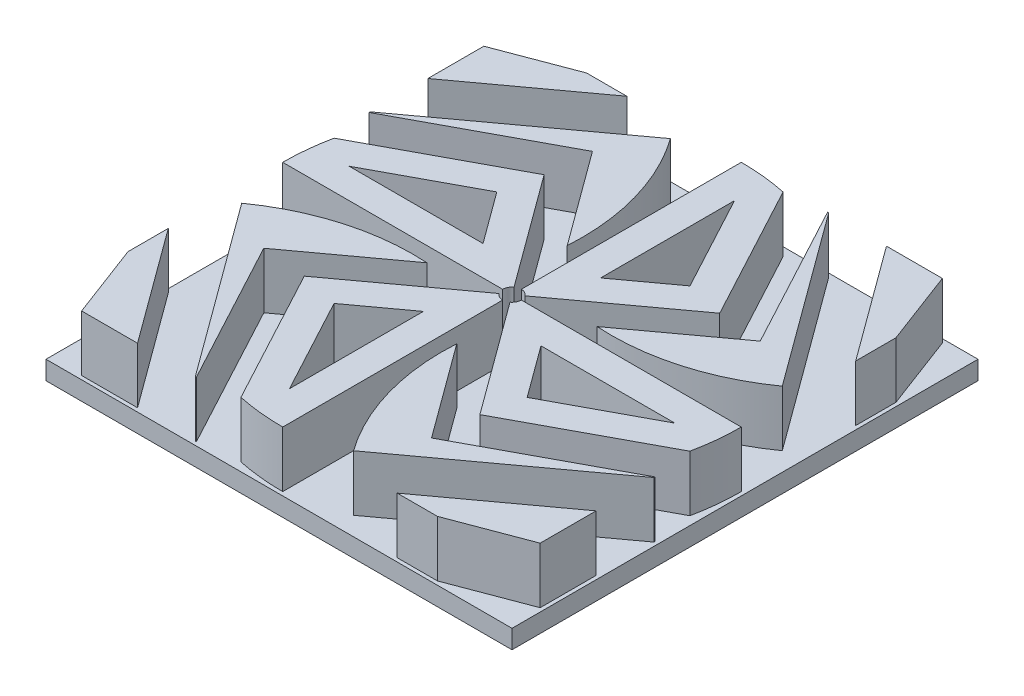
from build123d import *

# Parameters (mm, degrees)
SKETCH4_W           = 250
SKETCH4_H           = 250
BOSS_EXTRUDE1_DEPTH = 10
BOSS_EXTRUDE2_DEPTH = 30
CIRPATTERN2_COUNT   = 4


with BuildPart() as part:
    # Sketch4 → Boss-Extrude1 (new body)
    with BuildSketch(Plane(origin=(0, 0, 0), x_dir=(1, 0, 0), z_dir=(0, 1, 0))):
        Rectangle(SKETCH4_W, SKETCH4_H)
    extrude(amount=-BOSS_EXTRUDE1_DEPTH)

    # Sketch1 → Boss-Extrude2 (add)
    # profile 1 of 3: a face of its own
    with BuildSketch(Plane(origin=(0, 0, 0), x_dir=(1, 0, 0), z_dir=(0, 1, 0))):
        with BuildLine():
            Line((0, 5), (0, 123))
            ThreePointArc((0, 123), (12.565744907, 122.356454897), (25, 120.432553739))
            Line((25, 120.432553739), (64.336067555, 47.107069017))
            Line((64.336067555, 47.107069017), (4.034198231, 2.953852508))
            ThreePointArc((4.034198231, 2.953852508), (2.261718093, 4.459218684), (0, 5))
        make_face()
        Polygon((16, 103.363350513), (43.661739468, 51.799719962), (16, 31.54570818), align=None, mode=Mode.SUBTRACT)
    # profile 2 of 3: a face of its own
    with BuildSketch(Plane(origin=(0, 0, 0), x_dir=(1, 0, 0), z_dir=(0, 1, 0))):
        with BuildLine():
            Line((46.318817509, 123), (88.162567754, 45))
            Line((88.162567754, 45), (37.630141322, 8))
            ThreePointArc((37.630141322, 8), (78.213310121, 12.324249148), (115, 30))
            Line((115, 30), (46.905110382, 123))
            Line((46.905110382, 123), (46.318817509, 123))
        make_face()
    # profile 3 of 3: a face of its own
    with BuildSketch(Plane(origin=(0, 0, 0), x_dir=(1, 0, 0), z_dir=(0, 1, 0))):
        Polygon((123, 61.391687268), (77.890201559, 123), (107.890201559, 123), (123, 83), align=None)
    boss_extrude2 = extrude(amount=BOSS_EXTRUDE2_DEPTH)

    # CirPattern2: Boss-Extrude2 ×4 about axis
    cirpattern2_axis = Axis((0, 0, 0), (0, 1, 0))
    for i in range(1, CIRPATTERN2_COUNT):
        add(boss_extrude2.rotate(cirpattern2_axis, i * 360 / CIRPATTERN2_COUNT))


solid = part.part
